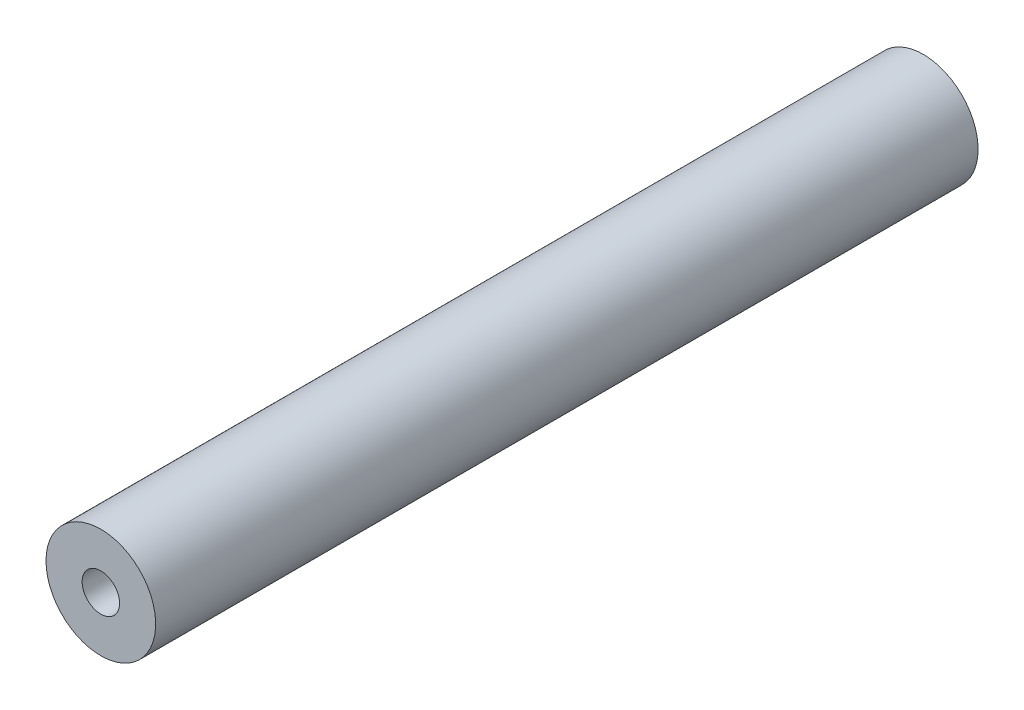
ISO-10303-21;
HEADER;
FILE_DESCRIPTION(('STEP AP214'),'2;1');
FILE_NAME('part.step','',(''),(''),'','','');
FILE_SCHEMA(('AUTOMOTIVE_DESIGN { 1 0 10303 214 1 1 1 1 }'));
ENDSEC;
DATA;
#1=APPLICATION_CONTEXT('core data for automotive mechanical design processes');
#2=APPLICATION_PROTOCOL_DEFINITION('international standard','automotive_design',2000,#1);
#3=PRODUCT_CONTEXT('',#1,'mechanical');
#4=PRODUCT('Part','Part','',(#3));
#5=PRODUCT_RELATED_PRODUCT_CATEGORY('part','',(#4));
#6=PRODUCT_DEFINITION_FORMATION('','',#4);
#7=PRODUCT_DEFINITION_CONTEXT('part definition',#1,'design');
#8=PRODUCT_DEFINITION('design','',#6,#7);
#9=PRODUCT_DEFINITION_SHAPE('','',#8);
#10=(LENGTH_UNIT() NAMED_UNIT(*) SI_UNIT(.MILLI.,.METRE.));
#11=(NAMED_UNIT(*) PLANE_ANGLE_UNIT() SI_UNIT($,.RADIAN.));
#12=(NAMED_UNIT(*) SI_UNIT($,.STERADIAN.) SOLID_ANGLE_UNIT());
#13=UNCERTAINTY_MEASURE_WITH_UNIT(LENGTH_MEASURE(1.E-05),#10,'distance_accuracy_value','');
#14=(GEOMETRIC_REPRESENTATION_CONTEXT(3) GLOBAL_UNCERTAINTY_ASSIGNED_CONTEXT((#13)) GLOBAL_UNIT_ASSIGNED_CONTEXT((#10,
#11,#12)) REPRESENTATION_CONTEXT('',''));
#15=CARTESIAN_POINT('',(0.,0.,0.));
#16=DIRECTION('',(0.,0.,1.));
#17=DIRECTION('',(1.,0.,0.));
#18=AXIS2_PLACEMENT_3D('',#15,#16,#17);
#19=CARTESIAN_POINT('',(0.,0.,45.));
#20=DIRECTION('',(0.,0.,-1.));
#21=DIRECTION('',(-1.,0.,0.));
#22=AXIS2_PLACEMENT_3D('',#19,#20,#21);
#23=CYLINDRICAL_SURFACE('',#22,3.);
#24=CARTESIAN_POINT('',(0.,0.,45.));
#25=DIRECTION('',(0.,0.,1.));
#26=DIRECTION('',(1.,0.,0.));
#27=AXIS2_PLACEMENT_3D('',#24,#25,#26);
#28=CIRCLE('',#27,3.);
#29=CARTESIAN_POINT('',(-3.,0.,45.));
#30=VERTEX_POINT('',#29);
#31=EDGE_CURVE('E11',#30,#30,#28,.T.);
#32=CARTESIAN_POINT('',(0.,0.,0.));
#33=DIRECTION('',(0.,0.,1.));
#34=DIRECTION('',(1.,0.,0.));
#35=AXIS2_PLACEMENT_3D('',#32,#33,#34);
#36=CIRCLE('',#35,3.);
#37=CARTESIAN_POINT('',(-3.,0.,0.));
#38=VERTEX_POINT('',#37);
#39=EDGE_CURVE('E43',#38,#38,#36,.T.);
#40=CARTESIAN_POINT('',(-3.,0.,45.));
#41=CARTESIAN_POINT('',(-3.,0.,44.53125));
#42=CARTESIAN_POINT('',(-3.,0.,44.0625));
#43=CARTESIAN_POINT('',(-3.,0.,43.125));
#44=CARTESIAN_POINT('',(-3.,0.,42.65625));
#45=CARTESIAN_POINT('',(-3.,0.,41.71875));
#46=CARTESIAN_POINT('',(-3.,0.,41.25));
#47=CARTESIAN_POINT('',(-3.,0.,40.3125));
#48=CARTESIAN_POINT('',(-3.,0.,39.84375));
#49=CARTESIAN_POINT('',(-3.,0.,38.90625));
#50=CARTESIAN_POINT('',(-3.,0.,38.4375));
#51=CARTESIAN_POINT('',(-3.,0.,37.5));
#52=CARTESIAN_POINT('',(-3.,0.,37.03125));
#53=CARTESIAN_POINT('',(-3.,0.,36.09375));
#54=CARTESIAN_POINT('',(-3.,0.,35.625));
#55=CARTESIAN_POINT('',(-3.,0.,34.6875));
#56=CARTESIAN_POINT('',(-3.,0.,34.21875));
#57=CARTESIAN_POINT('',(-3.,0.,33.28125));
#58=CARTESIAN_POINT('',(-3.,0.,32.8125));
#59=CARTESIAN_POINT('',(-3.,0.,31.875));
#60=CARTESIAN_POINT('',(-3.,0.,31.40625));
#61=CARTESIAN_POINT('',(-3.,0.,30.46875));
#62=CARTESIAN_POINT('',(-3.,0.,30.));
#63=CARTESIAN_POINT('',(-3.,0.,29.0625));
#64=CARTESIAN_POINT('',(-3.,0.,28.59375));
#65=CARTESIAN_POINT('',(-3.,0.,27.65625));
#66=CARTESIAN_POINT('',(-3.,0.,27.1875));
#67=CARTESIAN_POINT('',(-3.,0.,26.25));
#68=CARTESIAN_POINT('',(-3.,0.,25.78125));
#69=CARTESIAN_POINT('',(-3.,0.,24.84375));
#70=CARTESIAN_POINT('',(-3.,0.,24.375));
#71=CARTESIAN_POINT('',(-3.,0.,23.4375));
#72=CARTESIAN_POINT('',(-3.,0.,22.96875));
#73=CARTESIAN_POINT('',(-3.,0.,22.03125));
#74=CARTESIAN_POINT('',(-3.,0.,21.5625));
#75=CARTESIAN_POINT('',(-3.,0.,20.625));
#76=CARTESIAN_POINT('',(-3.,0.,20.15625));
#77=CARTESIAN_POINT('',(-3.,0.,19.21875));
#78=CARTESIAN_POINT('',(-3.,0.,18.75));
#79=CARTESIAN_POINT('',(-3.,0.,17.8125));
#80=CARTESIAN_POINT('',(-3.,0.,17.34375));
#81=CARTESIAN_POINT('',(-3.,0.,16.40625));
#82=CARTESIAN_POINT('',(-3.,0.,15.9375));
#83=CARTESIAN_POINT('',(-3.,0.,15.));
#84=CARTESIAN_POINT('',(-3.,0.,14.53125));
#85=CARTESIAN_POINT('',(-3.,0.,13.59375));
#86=CARTESIAN_POINT('',(-3.,0.,13.125));
#87=CARTESIAN_POINT('',(-3.,0.,12.1875));
#88=CARTESIAN_POINT('',(-3.,0.,11.71875));
#89=CARTESIAN_POINT('',(-3.,0.,10.78125));
#90=CARTESIAN_POINT('',(-3.,0.,10.3125));
#91=CARTESIAN_POINT('',(-3.,0.,9.375));
#92=CARTESIAN_POINT('',(-3.,0.,8.90625));
#93=CARTESIAN_POINT('',(-3.,0.,7.96874999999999));
#94=CARTESIAN_POINT('',(-3.,0.,7.5));
#95=CARTESIAN_POINT('',(-3.,0.,6.5625));
#96=CARTESIAN_POINT('',(-3.,0.,6.09375));
#97=CARTESIAN_POINT('',(-3.,0.,5.15625));
#98=CARTESIAN_POINT('',(-3.,0.,4.68749999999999));
#99=CARTESIAN_POINT('',(-3.,0.,3.74999999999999));
#100=CARTESIAN_POINT('',(-3.,0.,3.28124999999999));
#101=CARTESIAN_POINT('',(-3.,0.,2.34374999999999));
#102=CARTESIAN_POINT('',(-3.,0.,1.87499999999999));
#103=CARTESIAN_POINT('',(-3.,0.,0.937499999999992));
#104=CARTESIAN_POINT('',(-3.,0.,0.468749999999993));
#105=CARTESIAN_POINT('',(-3.,0.,0.));
#106=B_SPLINE_CURVE_WITH_KNOTS('',3,(#40,#41,#42,#43,#44,#45,#46,#47,#48,#49,#50,#51,#52,#53,
#54,#55,#56,#57,#58,#59,#60,#61,#62,#63,#64,#65,#66,#67,#68,#69,#70,#71,#72,#73,#74,#75,#76,#77,
#78,#79,#80,#81,#82,#83,#84,#85,#86,#87,#88,#89,#90,#91,#92,#93,#94,#95,#96,#97,#98,#99,#100,
#101,#102,#103,#104,#105),.UNSPECIFIED.,.F.,.F.,(4,2,2,2,2,2,2,2,2,2,2,2,2,2,2,2,2,2,2,2,2,2,2,
2,2,2,2,2,2,2,2,2,4),(0.,1.40625,2.8125,4.21875000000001,5.62500000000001,7.03125,8.4375,
9.84375000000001,11.25,12.65625,14.0625,15.46875,16.875,18.28125,19.6875,21.09375,22.5,23.90625,
25.3125,26.71875,28.125,29.53125,30.9375,32.34375,33.75,35.15625,36.5625,37.96875,39.375,
40.78125,42.1875,43.59375,45.),.UNSPECIFIED.);
#107=EDGE_CURVE('BSEAM40',#30,#38,#106,.T.);
#108=ORIENTED_EDGE('',*,*,#31,.F.);
#109=ORIENTED_EDGE('',*,*,#39,.T.);
#110=ORIENTED_EDGE('',*,*,#107,.T.);
#111=ORIENTED_EDGE('',*,*,#107,.F.);
#112=EDGE_LOOP('',(#108,#110,#109,#111));
#113=FACE_BOUND('',#112,.T.);
#114=ADVANCED_FACE('F40',(#113),#23,.T.);
#115=CARTESIAN_POINT('',(0.,0.,45.));
#116=DIRECTION('',(0.,0.,1.));
#117=DIRECTION('',(1.,0.,0.));
#118=AXIS2_PLACEMENT_3D('',#115,#116,#117);
#119=PLANE('',#118);
#120=CARTESIAN_POINT('',(0.,0.,45.));
#121=DIRECTION('',(0.,0.,1.));
#122=DIRECTION('',(1.,0.,0.));
#123=AXIS2_PLACEMENT_3D('',#120,#121,#122);
#124=CIRCLE('',#123,1.025);
#125=CARTESIAN_POINT('',(1.025,0.,45.));
#126=VERTEX_POINT('',#125);
#127=EDGE_CURVE('E65',#126,#126,#124,.T.);
#128=ORIENTED_EDGE('',*,*,#127,.F.);
#129=EDGE_LOOP('',(#128));
#130=FACE_BOUND('',#129,.T.);
#131=ORIENTED_EDGE('',*,*,#31,.T.);
#132=EDGE_LOOP('',(#131));
#133=FACE_BOUND('',#132,.T.);
#134=ADVANCED_FACE('F88',(#130,#133),#119,.T.);
#135=CARTESIAN_POINT('',(0.,0.,0.));
#136=DIRECTION('',(0.,0.,1.));
#137=DIRECTION('',(1.,0.,0.));
#138=AXIS2_PLACEMENT_3D('',#135,#136,#137);
#139=PLANE('',#138);
#140=CARTESIAN_POINT('',(0.,0.,0.));
#141=DIRECTION('',(0.,0.,-1.));
#142=DIRECTION('',(-1.,0.,0.));
#143=AXIS2_PLACEMENT_3D('',#140,#141,#142);
#144=CIRCLE('',#143,1.025);
#145=CARTESIAN_POINT('',(-1.025,0.,0.));
#146=VERTEX_POINT('',#145);
#147=EDGE_CURVE('E66',#146,#146,#144,.T.);
#148=ORIENTED_EDGE('',*,*,#147,.F.);
#149=EDGE_LOOP('',(#148));
#150=FACE_BOUND('',#149,.T.);
#151=ORIENTED_EDGE('',*,*,#39,.F.);
#152=EDGE_LOOP('',(#151));
#153=FACE_BOUND('',#152,.T.);
#154=ADVANCED_FACE('F85',(#150,#153),#139,.F.);
#155=CARTESIAN_POINT('',(0.,0.,37.));
#156=DIRECTION('',(0.,0.,1.));
#157=DIRECTION('',(1.,0.,0.));
#158=AXIS2_PLACEMENT_3D('',#155,#156,#157);
#159=CONICAL_SURFACE('',#158,1.025,1.02974425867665);
#160=CARTESIAN_POINT('',(0.,0.,36.3841178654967));
#161=VERTEX_POINT('',#160);
#162=VERTEX_LOOP('',#161);
#163=FACE_BOUND('',#162,.T.);
#164=CARTESIAN_POINT('',(0.,0.,37.));
#165=DIRECTION('',(0.,0.,1.));
#166=DIRECTION('',(1.,0.,0.));
#167=AXIS2_PLACEMENT_3D('',#164,#165,#166);
#168=CIRCLE('',#167,1.025);
#169=CARTESIAN_POINT('',(1.025,0.,37.));
#170=VERTEX_POINT('',#169);
#171=EDGE_CURVE('E71',#170,#170,#168,.T.);
#172=ORIENTED_EDGE('',*,*,#171,.T.);
#173=EDGE_LOOP('',(#172));
#174=FACE_BOUND('',#173,.T.);
#175=ADVANCED_FACE('F87',(#163,#174),#159,.F.);
#176=CARTESIAN_POINT('',(0.,0.,45.));
#177=DIRECTION('',(0.,0.,1.));
#178=DIRECTION('',(1.,0.,0.));
#179=AXIS2_PLACEMENT_3D('',#176,#177,#178);
#180=CYLINDRICAL_SURFACE('',#179,1.025);
#181=ORIENTED_EDGE('',*,*,#171,.F.);
#182=EDGE_LOOP('',(#181));
#183=FACE_BOUND('',#182,.T.);
#184=ORIENTED_EDGE('',*,*,#127,.T.);
#185=EDGE_LOOP('',(#184));
#186=FACE_BOUND('',#185,.T.);
#187=ADVANCED_FACE('F58',(#183,#186),#180,.F.);
#188=CARTESIAN_POINT('',(0.,0.,8.));
#189=DIRECTION('',(0.,0.,-1.));
#190=DIRECTION('',(-1.,0.,0.));
#191=AXIS2_PLACEMENT_3D('',#188,#189,#190);
#192=CONICAL_SURFACE('',#191,1.025,1.02974425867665);
#193=CARTESIAN_POINT('',(0.,0.,8.61588213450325));
#194=VERTEX_POINT('',#193);
#195=VERTEX_LOOP('',#194);
#196=FACE_BOUND('',#195,.T.);
#197=CARTESIAN_POINT('',(0.,0.,8.));
#198=DIRECTION('',(0.,0.,-1.));
#199=DIRECTION('',(-1.,0.,0.));
#200=AXIS2_PLACEMENT_3D('',#197,#198,#199);
#201=CIRCLE('',#200,1.025);
#202=CARTESIAN_POINT('',(-1.025,0.,8.));
#203=VERTEX_POINT('',#202);
#204=EDGE_CURVE('E62',#203,#203,#201,.T.);
#205=ORIENTED_EDGE('',*,*,#204,.T.);
#206=EDGE_LOOP('',(#205));
#207=FACE_BOUND('',#206,.T.);
#208=ADVANCED_FACE('F54',(#196,#207),#192,.F.);
#209=CARTESIAN_POINT('',(0.,0.,0.));
#210=DIRECTION('',(0.,0.,-1.));
#211=DIRECTION('',(-1.,0.,0.));
#212=AXIS2_PLACEMENT_3D('',#209,#210,#211);
#213=CYLINDRICAL_SURFACE('',#212,1.025);
#214=ORIENTED_EDGE('',*,*,#204,.F.);
#215=EDGE_LOOP('',(#214));
#216=FACE_BOUND('',#215,.T.);
#217=ORIENTED_EDGE('',*,*,#147,.T.);
#218=EDGE_LOOP('',(#217));
#219=FACE_BOUND('',#218,.T.);
#220=ADVANCED_FACE('F57',(#216,#219),#213,.F.);
#221=CLOSED_SHELL('',(#114,#134,#154,#175,#187,#208,#220));
#222=MANIFOLD_SOLID_BREP('B2',#221);
#223=ADVANCED_BREP_SHAPE_REPRESENTATION('',(#18,#222),#14);
#224=SHAPE_DEFINITION_REPRESENTATION(#9,#223);
ENDSEC;
END-ISO-10303-21;
